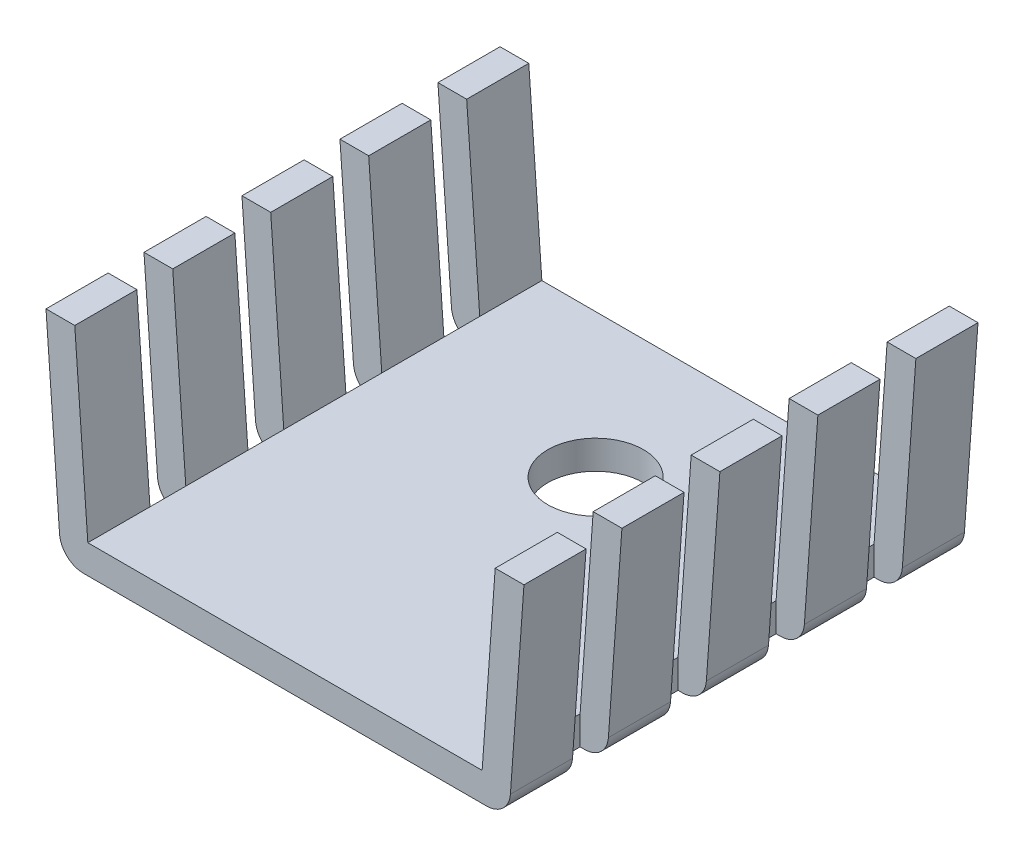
from build123d import *

# Parameters (mm, degrees)
BOSS_EXTRU_1_DEPTH      = 19
ESQUISSE2_W             = 1.5
ESQUISSE2_H             = 8.018996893
ENL_V_MAT_EXTRU_1_DEPTH = 10
ESQUISSE3_R             = 2
ESQUISSE3_W             = 1.622820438
ESQUISSE3_H             = 1.5
ENL_V_MAT_EXTRU_2_DEPTH = 23.776303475


with BuildPart() as part:
    # Esquisse1 → Boss.-Extru.1 (new body)
    with BuildSketch(Plane.XY):
        with BuildLine():
            Line((8.25, 1.2), (8.796897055, 8.8))
            Line((8.796897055, 8.8), (10, 8.8))
            Line((10, 8.8), (9.433546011, 0.928225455))
            ThreePointArc((9.433546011, 0.928225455), (9.117383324, 0.267956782), (8.43612513, 0))
            Line((8.43612513, 0), (-8.43612513, 0))
            ThreePointArc((-8.43612513, 0), (-9.117383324, 0.267956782), (-9.433546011, 0.928225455))
            Line((-9.433546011, 0.928225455), (-10, 8.8))
            Line((-10, 8.8), (-8.796897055, 8.8))
            Line((-8.796897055, 8.8), (-8.25, 1.2))
            Line((-8.25, 1.2), (8.25, 1.2))
        make_face()
    extrude(amount=BOSS_EXTRU_1_DEPTH)

    # Esquisse2 → Enl_v. mat.-Extru.1 (cut, symmetric)
    with BuildSketch(Plane(origin=(0, 0, 0), x_dir=(0, 0, -1), z_dir=(1, 0, 0))):
        with Locations((-7.45, 5.209498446)):
            Rectangle(ESQUISSE2_W, ESQUISSE2_H)
        with Locations((-15.65, 5.209498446)):
            Rectangle(ESQUISSE2_W, ESQUISSE2_H)
        with Locations((-11.55, 5.209498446)):
            Rectangle(ESQUISSE2_W, ESQUISSE2_H)
        with Locations((-3.35, 5.209498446)):
            Rectangle(ESQUISSE2_W, ESQUISSE2_H)
    extrude(amount=ENL_V_MAT_EXTRU_1_DEPTH, both=True, mode=Mode.SUBTRACT)

    # Esquisse3 → Enl_v. mat.-Extru.2 (cut, through all)
    with BuildSketch(Plane(origin=(0, 1.2, 0), x_dir=(1, 0, 0), z_dir=(0, 1, 0))):
        with Locations(Location((0, -6, 0), (0, 0, 180))):
            Circle(ESQUISSE3_R)
        with Locations((9.061410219, -7.45)):
            Rectangle(ESQUISSE3_W, ESQUISSE3_H)
        with Locations((9.061410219, -3.35)):
            Rectangle(ESQUISSE3_W, ESQUISSE3_H)
        with Locations((9.061410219, -11.55)):
            Rectangle(ESQUISSE3_W, ESQUISSE3_H)
        with Locations((9.061410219, -15.65)):
            Rectangle(ESQUISSE3_W, ESQUISSE3_H)
        with Locations((-9.061410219, -15.65)):
            Rectangle(ESQUISSE3_W, ESQUISSE3_H)
        with Locations((-9.061410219, -11.55)):
            Rectangle(ESQUISSE3_W, ESQUISSE3_H)
        with Locations((-9.061410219, -7.45)):
            Rectangle(ESQUISSE3_W, ESQUISSE3_H)
        with Locations((-9.061410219, -3.35)):
            Rectangle(ESQUISSE3_W, ESQUISSE3_H)
    extrude(amount=-ENL_V_MAT_EXTRU_2_DEPTH, mode=Mode.SUBTRACT)


solid = part.part
